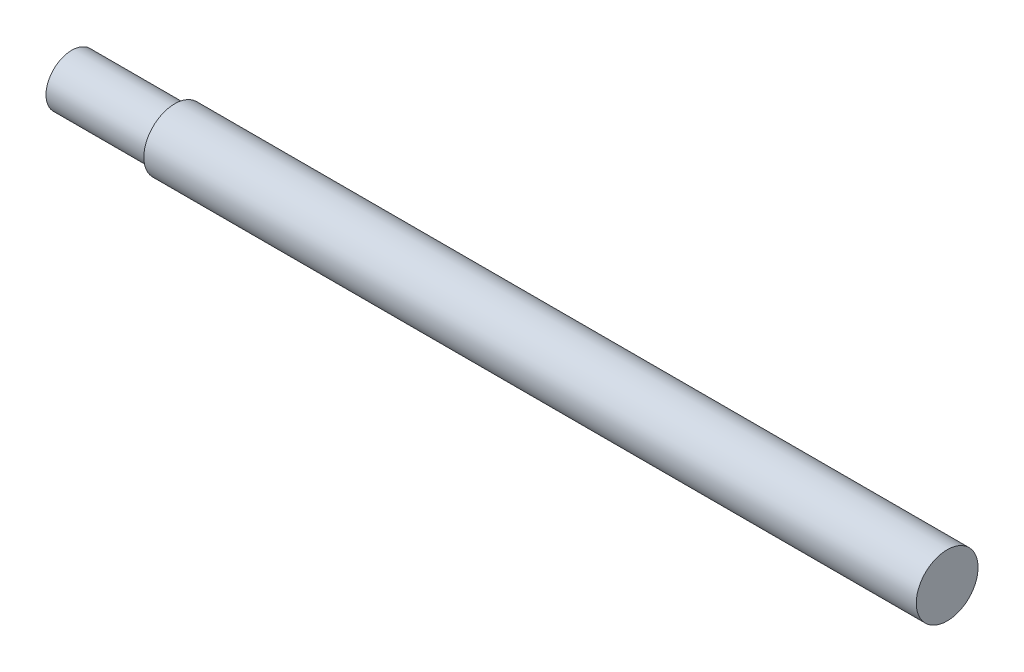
from build123d import *


with BuildPart() as part:
    # Esquisse1 → R_volution1 (revolve)
    with BuildSketch(Plane.XY, mode=Mode.PRIVATE) as r_volution1_sk:
        Polygon((-75.830261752, 0), (-75.830261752, 5), (-55.830261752, 5), (-55.830261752, 6), (94.169738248, 6), (94.169738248, 0), align=None)
    revolve(r_volution1_sk.sketch.rotate(Axis((-81.606850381, 0, 0), (1, 0, 0)), 90), axis=Axis((-81.606850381, 0, 0), (1, 0, 0)))


solid = part.part
